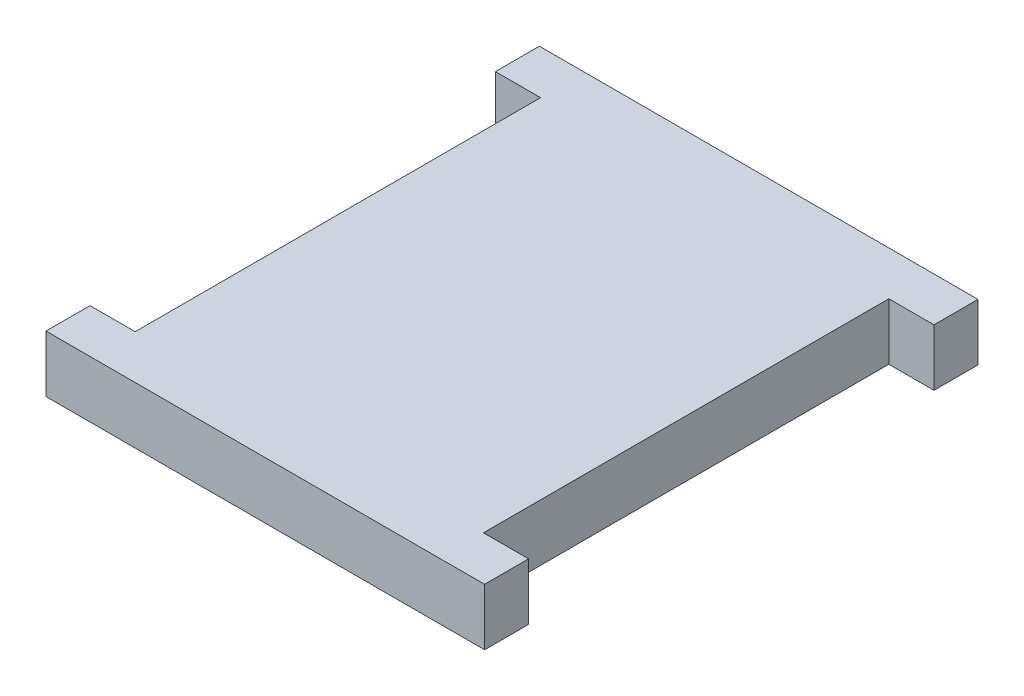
from build123d import *

# Parameters (mm, degrees)
BOSS_EXTRUDE1_DEPTH = 8.8


with BuildPart() as part:
    # Sketch1 → Boss-Extrude1 (new, symmetric)
    with BuildSketch(Plane(origin=(0, 0, 0), x_dir=(1, 0, 0), z_dir=(0, 1, 0))):
        Polygon((-68, 62.85), (-54, 62.85), (-54, -62.85), (-68, -62.85), (-68, -76.5), (68, -76.5), (68, -62.85), (54, -62.85), (54, 62.85), (68, 62.85), (68, 76.5), (-68, 76.5), align=None)
    extrude(amount=BOSS_EXTRUDE1_DEPTH, both=True)


solid = part.part
